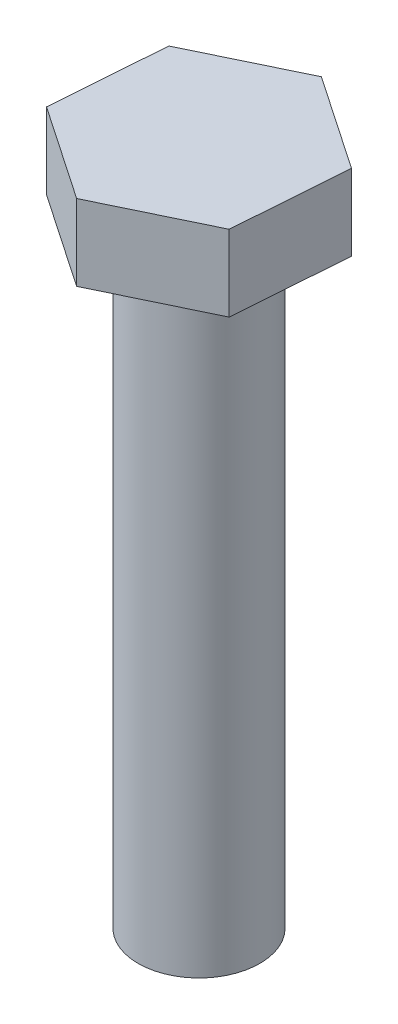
ISO-10303-21;
HEADER;
FILE_DESCRIPTION(('STEP AP214'),'2;1');
FILE_NAME('part.step','',(''),(''),'','','');
FILE_SCHEMA(('AUTOMOTIVE_DESIGN { 1 0 10303 214 1 1 1 1 }'));
ENDSEC;
DATA;
#1=APPLICATION_CONTEXT('core data for automotive mechanical design processes');
#2=APPLICATION_PROTOCOL_DEFINITION('international standard','automotive_design',2000,#1);
#3=PRODUCT_CONTEXT('',#1,'mechanical');
#4=PRODUCT('Part','Part','',(#3));
#5=PRODUCT_RELATED_PRODUCT_CATEGORY('part','',(#4));
#6=PRODUCT_DEFINITION_FORMATION('','',#4);
#7=PRODUCT_DEFINITION_CONTEXT('part definition',#1,'design');
#8=PRODUCT_DEFINITION('design','',#6,#7);
#9=PRODUCT_DEFINITION_SHAPE('','',#8);
#10=(LENGTH_UNIT() NAMED_UNIT(*) SI_UNIT(.MILLI.,.METRE.));
#11=(NAMED_UNIT(*) PLANE_ANGLE_UNIT() SI_UNIT($,.RADIAN.));
#12=(NAMED_UNIT(*) SI_UNIT($,.STERADIAN.) SOLID_ANGLE_UNIT());
#13=UNCERTAINTY_MEASURE_WITH_UNIT(LENGTH_MEASURE(1.E-05),#10,'distance_accuracy_value','');
#14=(GEOMETRIC_REPRESENTATION_CONTEXT(3) GLOBAL_UNCERTAINTY_ASSIGNED_CONTEXT((#13)) GLOBAL_UNIT_ASSIGNED_CONTEXT((#10,
#11,#12)) REPRESENTATION_CONTEXT('',''));
#15=CARTESIAN_POINT('',(0.,0.,0.));
#16=DIRECTION('',(0.,0.,1.));
#17=DIRECTION('',(1.,0.,0.));
#18=AXIS2_PLACEMENT_3D('',#15,#16,#17);
#19=CARTESIAN_POINT('',(0.,0.,0.));
#20=DIRECTION('',(0.,1.,0.));
#21=DIRECTION('',(0.,0.,1.));
#22=AXIS2_PLACEMENT_3D('',#19,#20,#21);
#23=PLANE('',#22);
#24=CARTESIAN_POINT('',(0.,0.,0.));
#25=DIRECTION('',(0.,1.,0.));
#26=DIRECTION('',(0.,0.,1.));
#27=AXIS2_PLACEMENT_3D('',#24,#25,#26);
#28=CIRCLE('',#27,4.);
#29=CARTESIAN_POINT('',(0.,0.,4.));
#30=VERTEX_POINT('',#29);
#31=EDGE_CURVE('E42',#30,#30,#28,.T.);
#32=ORIENTED_EDGE('',*,*,#31,.T.);
#33=EDGE_LOOP('',(#32));
#34=FACE_BOUND('',#33,.T.);
#35=DIRECTION('',(0.0741810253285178,0.,-0.997244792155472));
#36=VECTOR('',#35,1.);
#37=CARTESIAN_POINT('',(6.20370632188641,0.,4.22461373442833));
#38=LINE('',#37,#36);
#39=CARTESIAN_POINT('',(6.20370632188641,0.,4.22461373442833));
#40=VERTEX_POINT('',#39);
#41=CARTESIAN_POINT('',(6.76047597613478,0.,-3.26026040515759));
#42=VERTEX_POINT('',#41);
#43=EDGE_CURVE('E110',#40,#42,#38,.T.);
#44=ORIENTED_EDGE('',*,*,#43,.F.);
#45=DIRECTION('',(0.90072983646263,0.,-0.434379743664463));
#46=VECTOR('',#45,1.);
#47=CARTESIAN_POINT('',(-0.556769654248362,0.,7.48487413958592));
#48=LINE('',#47,#46);
#49=CARTESIAN_POINT('',(-0.556769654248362,0.,7.48487413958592));
#50=VERTEX_POINT('',#49);
#51=EDGE_CURVE('E126',#50,#40,#48,.T.);
#52=ORIENTED_EDGE('',*,*,#51,.F.);
#53=DIRECTION('',(0.826548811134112,0.,0.562865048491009));
#54=VECTOR('',#53,1.);
#55=CARTESIAN_POINT('',(-6.76047597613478,0.,3.26026040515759));
#56=LINE('',#55,#54);
#57=CARTESIAN_POINT('',(-6.76047597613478,0.,3.26026040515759));
#58=VERTEX_POINT('',#57);
#59=EDGE_CURVE('E123',#58,#50,#56,.T.);
#60=ORIENTED_EDGE('',*,*,#59,.F.);
#61=DIRECTION('',(-0.0741810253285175,0.,0.997244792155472));
#62=VECTOR('',#61,1.);
#63=CARTESIAN_POINT('',(-6.20370632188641,0.,-4.22461373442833));
#64=LINE('',#63,#62);
#65=CARTESIAN_POINT('',(-6.20370632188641,0.,-4.22461373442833));
#66=VERTEX_POINT('',#65);
#67=EDGE_CURVE('E81',#66,#58,#64,.T.);
#68=ORIENTED_EDGE('',*,*,#67,.F.);
#69=DIRECTION('',(-0.90072983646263,0.,0.434379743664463));
#70=VECTOR('',#69,1.);
#71=CARTESIAN_POINT('',(0.556769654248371,0.,-7.48487413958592));
#72=LINE('',#71,#70);
#73=CARTESIAN_POINT('',(0.556769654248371,0.,-7.48487413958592));
#74=VERTEX_POINT('',#73);
#75=EDGE_CURVE('E77',#74,#66,#72,.T.);
#76=ORIENTED_EDGE('',*,*,#75,.F.);
#77=DIRECTION('',(-0.826548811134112,0.,-0.562865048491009));
#78=VECTOR('',#77,1.);
#79=CARTESIAN_POINT('',(6.76047597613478,0.,-3.26026040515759));
#80=LINE('',#79,#78);
#81=EDGE_CURVE('E130',#42,#74,#80,.T.);
#82=ORIENTED_EDGE('',*,*,#81,.F.);
#83=EDGE_LOOP('',(#44,#52,#60,#68,#76,#82));
#84=FACE_BOUND('',#83,.T.);
#85=ADVANCED_FACE('F39',(#34,#84),#23,.F.);
#86=CARTESIAN_POINT('',(0.,-40.,0.));
#87=DIRECTION('',(0.,1.,0.));
#88=DIRECTION('',(0.,0.,1.));
#89=AXIS2_PLACEMENT_3D('',#86,#87,#88);
#90=CYLINDRICAL_SURFACE('',#89,4.);
#91=CARTESIAN_POINT('',(0.,-40.,0.));
#92=DIRECTION('',(0.,1.,0.));
#93=DIRECTION('',(0.,0.,1.));
#94=AXIS2_PLACEMENT_3D('',#91,#92,#93);
#95=CIRCLE('',#94,4.);
#96=CARTESIAN_POINT('',(0.,-40.,4.));
#97=VERTEX_POINT('',#96);
#98=EDGE_CURVE('E11',#97,#97,#95,.T.);
#99=ORIENTED_EDGE('',*,*,#98,.T.);
#100=EDGE_LOOP('',(#99));
#101=FACE_BOUND('',#100,.T.);
#102=ORIENTED_EDGE('',*,*,#31,.F.);
#103=EDGE_LOOP('',(#102));
#104=FACE_BOUND('',#103,.T.);
#105=ADVANCED_FACE('F148',(#101,#104),#90,.T.);
#106=CARTESIAN_POINT('',(0.,-40.,0.));
#107=DIRECTION('',(0.,1.,0.));
#108=DIRECTION('',(0.,0.,1.));
#109=AXIS2_PLACEMENT_3D('',#106,#107,#108);
#110=PLANE('',#109);
#111=ORIENTED_EDGE('',*,*,#98,.F.);
#112=EDGE_LOOP('',(#111));
#113=FACE_BOUND('',#112,.T.);
#114=ADVANCED_FACE('F150',(#113),#110,.F.);
#115=CARTESIAN_POINT('',(-6.20370632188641,5.,-4.22461373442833));
#116=DIRECTION('',(0.997244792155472,0.,0.0741810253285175));
#117=DIRECTION('',(0.0741810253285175,0.,-0.997244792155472));
#118=AXIS2_PLACEMENT_3D('',#115,#116,#117);
#119=PLANE('',#118);
#120=DIRECTION('',(0.,-1.,0.));
#121=VECTOR('',#120,1.);
#122=CARTESIAN_POINT('',(-6.76047597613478,5.,3.26026040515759));
#123=LINE('',#122,#121);
#124=CARTESIAN_POINT('',(-6.76047597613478,5.,3.26026040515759));
#125=VERTEX_POINT('',#124);
#126=EDGE_CURVE('E140',#125,#58,#123,.T.);
#127=ORIENTED_EDGE('',*,*,#126,.F.);
#128=DIRECTION('',(-0.0741810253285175,0.,0.997244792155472));
#129=VECTOR('',#128,1.);
#130=CARTESIAN_POINT('',(-6.20370632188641,5.,-4.22461373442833));
#131=LINE('',#130,#129);
#132=CARTESIAN_POINT('',(-6.20370632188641,5.,-4.22461373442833));
#133=VERTEX_POINT('',#132);
#134=EDGE_CURVE('E86',#133,#125,#131,.T.);
#135=ORIENTED_EDGE('',*,*,#134,.F.);
#136=DIRECTION('',(0.,-1.,0.));
#137=VECTOR('',#136,1.);
#138=CARTESIAN_POINT('',(-6.20370632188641,5.,-4.22461373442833));
#139=LINE('',#138,#137);
#140=EDGE_CURVE('E118',#133,#66,#139,.T.);
#141=ORIENTED_EDGE('',*,*,#140,.T.);
#142=ORIENTED_EDGE('',*,*,#67,.T.);
#143=EDGE_LOOP('',(#127,#135,#141,#142));
#144=FACE_BOUND('',#143,.T.);
#145=ADVANCED_FACE('F156',(#144),#119,.F.);
#146=CARTESIAN_POINT('',(-6.76047597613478,5.,3.26026040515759));
#147=DIRECTION('',(0.562865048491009,0.,-0.826548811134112));
#148=DIRECTION('',(-0.826548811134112,0.,-0.562865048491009));
#149=AXIS2_PLACEMENT_3D('',#146,#147,#148);
#150=PLANE('',#149);
#151=DIRECTION('',(0.,-1.,0.));
#152=VECTOR('',#151,1.);
#153=CARTESIAN_POINT('',(-0.556769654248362,5.,7.48487413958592));
#154=LINE('',#153,#152);
#155=CARTESIAN_POINT('',(-0.556769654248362,5.,7.48487413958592));
#156=VERTEX_POINT('',#155);
#157=EDGE_CURVE('E137',#156,#50,#154,.T.);
#158=ORIENTED_EDGE('',*,*,#157,.F.);
#159=DIRECTION('',(0.826548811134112,0.,0.562865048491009));
#160=VECTOR('',#159,1.);
#161=CARTESIAN_POINT('',(-6.76047597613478,5.,3.26026040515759));
#162=LINE('',#161,#160);
#163=EDGE_CURVE('E185',#125,#156,#162,.T.);
#164=ORIENTED_EDGE('',*,*,#163,.F.);
#165=ORIENTED_EDGE('',*,*,#126,.T.);
#166=ORIENTED_EDGE('',*,*,#59,.T.);
#167=EDGE_LOOP('',(#158,#164,#165,#166));
#168=FACE_BOUND('',#167,.T.);
#169=ADVANCED_FACE('F178',(#168),#150,.F.);
#170=CARTESIAN_POINT('',(-0.556769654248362,5.,7.48487413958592));
#171=DIRECTION('',(-0.434379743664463,0.,-0.90072983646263));
#172=DIRECTION('',(-0.90072983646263,0.,0.434379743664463));
#173=AXIS2_PLACEMENT_3D('',#170,#171,#172);
#174=PLANE('',#173);
#175=DIRECTION('',(0.90072983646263,0.,-0.434379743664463));
#176=VECTOR('',#175,1.);
#177=CARTESIAN_POINT('',(-0.556769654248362,5.,7.48487413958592));
#178=LINE('',#177,#176);
#179=CARTESIAN_POINT('',(6.20370632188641,5.,4.22461373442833));
#180=VERTEX_POINT('',#179);
#181=EDGE_CURVE('E101',#156,#180,#178,.T.);
#182=ORIENTED_EDGE('',*,*,#181,.F.);
#183=ORIENTED_EDGE('',*,*,#157,.T.);
#184=ORIENTED_EDGE('',*,*,#51,.T.);
#185=DIRECTION('',(0.,-1.,0.));
#186=VECTOR('',#185,1.);
#187=CARTESIAN_POINT('',(6.20370632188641,5.,4.22461373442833));
#188=LINE('',#187,#186);
#189=EDGE_CURVE('E112',#180,#40,#188,.T.);
#190=ORIENTED_EDGE('',*,*,#189,.F.);
#191=EDGE_LOOP('',(#182,#183,#184,#190));
#192=FACE_BOUND('',#191,.T.);
#193=ADVANCED_FACE('F175',(#192),#174,.F.);
#194=CARTESIAN_POINT('',(6.20370632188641,5.,4.22461373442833));
#195=DIRECTION('',(-0.997244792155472,0.,-0.0741810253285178));
#196=DIRECTION('',(-0.0741810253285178,0.,0.997244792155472));
#197=AXIS2_PLACEMENT_3D('',#194,#195,#196);
#198=PLANE('',#197);
#199=DIRECTION('',(0.,-1.,0.));
#200=VECTOR('',#199,1.);
#201=CARTESIAN_POINT('',(6.76047597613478,5.,-3.26026040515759));
#202=LINE('',#201,#200);
#203=CARTESIAN_POINT('',(6.76047597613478,5.,-3.26026040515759));
#204=VERTEX_POINT('',#203);
#205=EDGE_CURVE('E108',#204,#42,#202,.T.);
#206=ORIENTED_EDGE('',*,*,#205,.F.);
#207=DIRECTION('',(0.0741810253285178,0.,-0.997244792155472));
#208=VECTOR('',#207,1.);
#209=CARTESIAN_POINT('',(6.20370632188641,5.,4.22461373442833));
#210=LINE('',#209,#208);
#211=EDGE_CURVE('E94',#180,#204,#210,.T.);
#212=ORIENTED_EDGE('',*,*,#211,.F.);
#213=ORIENTED_EDGE('',*,*,#189,.T.);
#214=ORIENTED_EDGE('',*,*,#43,.T.);
#215=EDGE_LOOP('',(#206,#212,#213,#214));
#216=FACE_BOUND('',#215,.T.);
#217=ADVANCED_FACE('F109',(#216),#198,.F.);
#218=CARTESIAN_POINT('',(6.76047597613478,5.,-3.26026040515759));
#219=DIRECTION('',(-0.562865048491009,0.,0.826548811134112));
#220=DIRECTION('',(0.826548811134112,0.,0.562865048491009));
#221=AXIS2_PLACEMENT_3D('',#218,#219,#220);
#222=PLANE('',#221);
#223=DIRECTION('',(0.,-1.,0.));
#224=VECTOR('',#223,1.);
#225=CARTESIAN_POINT('',(0.556769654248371,5.,-7.48487413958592));
#226=LINE('',#225,#224);
#227=CARTESIAN_POINT('',(0.556769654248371,5.,-7.48487413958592));
#228=VERTEX_POINT('',#227);
#229=EDGE_CURVE('E113',#228,#74,#226,.T.);
#230=ORIENTED_EDGE('',*,*,#229,.F.);
#231=DIRECTION('',(-0.826548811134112,0.,-0.562865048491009));
#232=VECTOR('',#231,1.);
#233=CARTESIAN_POINT('',(6.76047597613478,5.,-3.26026040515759));
#234=LINE('',#233,#232);
#235=EDGE_CURVE('E98',#204,#228,#234,.T.);
#236=ORIENTED_EDGE('',*,*,#235,.F.);
#237=ORIENTED_EDGE('',*,*,#205,.T.);
#238=ORIENTED_EDGE('',*,*,#81,.T.);
#239=EDGE_LOOP('',(#230,#236,#237,#238));
#240=FACE_BOUND('',#239,.T.);
#241=ADVANCED_FACE('F115',(#240),#222,.F.);
#242=CARTESIAN_POINT('',(0.556769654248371,5.,-7.48487413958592));
#243=DIRECTION('',(0.434379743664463,0.,0.90072983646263));
#244=DIRECTION('',(0.90072983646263,0.,-0.434379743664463));
#245=AXIS2_PLACEMENT_3D('',#242,#243,#244);
#246=PLANE('',#245);
#247=ORIENTED_EDGE('',*,*,#140,.F.);
#248=DIRECTION('',(-0.90072983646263,0.,0.434379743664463));
#249=VECTOR('',#248,1.);
#250=CARTESIAN_POINT('',(0.556769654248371,5.,-7.48487413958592));
#251=LINE('',#250,#249);
#252=EDGE_CURVE('E55',#228,#133,#251,.T.);
#253=ORIENTED_EDGE('',*,*,#252,.F.);
#254=ORIENTED_EDGE('',*,*,#229,.T.);
#255=ORIENTED_EDGE('',*,*,#75,.T.);
#256=EDGE_LOOP('',(#247,#253,#254,#255));
#257=FACE_BOUND('',#256,.T.);
#258=ADVANCED_FACE('F162',(#257),#246,.F.);
#259=CARTESIAN_POINT('',(0.,5.,0.));
#260=DIRECTION('',(0.,1.,0.));
#261=DIRECTION('',(0.,0.,1.));
#262=AXIS2_PLACEMENT_3D('',#259,#260,#261);
#263=PLANE('',#262);
#264=ORIENTED_EDGE('',*,*,#163,.T.);
#265=ORIENTED_EDGE('',*,*,#181,.T.);
#266=ORIENTED_EDGE('',*,*,#211,.T.);
#267=ORIENTED_EDGE('',*,*,#235,.T.);
#268=ORIENTED_EDGE('',*,*,#252,.T.);
#269=ORIENTED_EDGE('',*,*,#134,.T.);
#270=EDGE_LOOP('',(#264,#265,#266,#267,#268,#269));
#271=FACE_BOUND('',#270,.T.);
#272=ADVANCED_FACE('F96',(#271),#263,.T.);
#273=CLOSED_SHELL('',(#85,#105,#114,#145,#169,#193,#217,#241,#258,#272));
#274=MANIFOLD_SOLID_BREP('B2',#273);
#275=ADVANCED_BREP_SHAPE_REPRESENTATION('',(#18,#274),#14);
#276=SHAPE_DEFINITION_REPRESENTATION(#9,#275);
ENDSEC;
END-ISO-10303-21;
